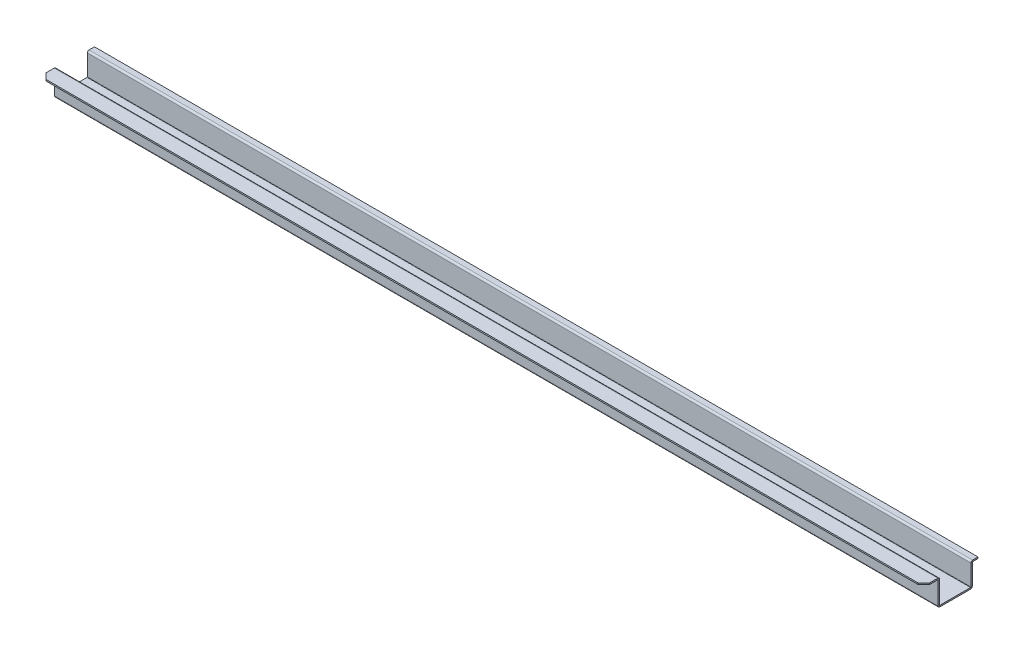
ISO-10303-21;
HEADER;
FILE_DESCRIPTION(('STEP AP214'),'2;1');
FILE_NAME('part.step','',(''),(''),'','','');
FILE_SCHEMA(('AUTOMOTIVE_DESIGN { 1 0 10303 214 1 1 1 1 }'));
ENDSEC;
DATA;
#1=APPLICATION_CONTEXT('core data for automotive mechanical design processes');
#2=APPLICATION_PROTOCOL_DEFINITION('international standard','automotive_design',2000,#1);
#3=PRODUCT_CONTEXT('',#1,'mechanical');
#4=PRODUCT('Part','Part','',(#3));
#5=PRODUCT_RELATED_PRODUCT_CATEGORY('part','',(#4));
#6=PRODUCT_DEFINITION_FORMATION('','',#4);
#7=PRODUCT_DEFINITION_CONTEXT('part definition',#1,'design');
#8=PRODUCT_DEFINITION('design','',#6,#7);
#9=PRODUCT_DEFINITION_SHAPE('','',#8);
#10=(LENGTH_UNIT() NAMED_UNIT(*) SI_UNIT(.MILLI.,.METRE.));
#11=(NAMED_UNIT(*) PLANE_ANGLE_UNIT() SI_UNIT($,.RADIAN.));
#12=(NAMED_UNIT(*) SI_UNIT($,.STERADIAN.) SOLID_ANGLE_UNIT());
#13=UNCERTAINTY_MEASURE_WITH_UNIT(LENGTH_MEASURE(1.E-05),#10,'distance_accuracy_value','');
#14=(GEOMETRIC_REPRESENTATION_CONTEXT(3) GLOBAL_UNCERTAINTY_ASSIGNED_CONTEXT((#13)) GLOBAL_UNIT_ASSIGNED_CONTEXT((#10,
#11,#12)) REPRESENTATION_CONTEXT('',''));
#15=CARTESIAN_POINT('',(0.,0.,0.));
#16=DIRECTION('',(0.,0.,1.));
#17=DIRECTION('',(1.,0.,0.));
#18=AXIS2_PLACEMENT_3D('',#15,#16,#17);
#19=CARTESIAN_POINT('',(1550.,-6.,0.));
#20=DIRECTION('',(1.,0.,0.));
#21=DIRECTION('',(0.,0.,-1.));
#22=AXIS2_PLACEMENT_3D('',#19,#20,#21);
#23=PLANE('',#22);
#24=DIRECTION('',(0.,0.,1.));
#25=VECTOR('',#24,1.);
#26=CARTESIAN_POINT('',(1550.,-6.,0.));
#27=LINE('',#26,#25);
#28=CARTESIAN_POINT('',(1550.,-6.,0.));
#29=VERTEX_POINT('',#28);
#30=CARTESIAN_POINT('',(1550.,-6.,5.));
#31=VERTEX_POINT('',#30);
#32=EDGE_CURVE('E395',#29,#31,#27,.T.);
#33=ORIENTED_EDGE('',*,*,#32,.F.);
#34=CARTESIAN_POINT('',(1550.,-6.,6.));
#35=DIRECTION('',(1.,0.,0.));
#36=DIRECTION('',(0.,0.,-1.));
#37=AXIS2_PLACEMENT_3D('',#34,#35,#36);
#38=CIRCLE('',#37,6.);
#39=CARTESIAN_POINT('',(1550.,0.,6.));
#40=VERTEX_POINT('',#39);
#41=EDGE_CURVE('E235',#40,#29,#38,.F.);
#42=ORIENTED_EDGE('',*,*,#41,.F.);
#43=DIRECTION('',(0.,1.,0.));
#44=VECTOR('',#43,1.);
#45=CARTESIAN_POINT('',(1550.,-5.,6.));
#46=LINE('',#45,#44);
#47=CARTESIAN_POINT('',(1550.,-5.,6.));
#48=VERTEX_POINT('',#47);
#49=EDGE_CURVE('E392',#48,#40,#46,.T.);
#50=ORIENTED_EDGE('',*,*,#49,.F.);
#51=CARTESIAN_POINT('',(1550.,-6.,6.));
#52=DIRECTION('',(1.,0.,0.));
#53=DIRECTION('',(0.,0.,-1.));
#54=AXIS2_PLACEMENT_3D('',#51,#52,#53);
#55=CIRCLE('',#54,1.);
#56=EDGE_CURVE('E242',#48,#31,#55,.F.);
#57=ORIENTED_EDGE('',*,*,#56,.T.);
#58=EDGE_LOOP('',(#33,#42,#50,#57));
#59=FACE_BOUND('',#58,.T.);
#60=ADVANCED_FACE('F39',(#59),#23,.T.);
#61=CARTESIAN_POINT('',(1550.,-5.,6.));
#62=DIRECTION('',(1.,0.,0.));
#63=DIRECTION('',(0.,0.,-1.));
#64=AXIS2_PLACEMENT_3D('',#61,#62,#63);
#65=PLANE('',#64);
#66=DIRECTION('',(0.,-1.,0.));
#67=VECTOR('',#66,1.);
#68=CARTESIAN_POINT('',(1550.,0.,0.));
#69=LINE('',#68,#67);
#70=CARTESIAN_POINT('',(1550.,-85.,0.));
#71=VERTEX_POINT('',#70);
#72=EDGE_CURVE('E232',#29,#71,#69,.T.);
#73=ORIENTED_EDGE('',*,*,#72,.F.);
#74=ORIENTED_EDGE('',*,*,#32,.T.);
#75=DIRECTION('',(0.,-1.,0.));
#76=VECTOR('',#75,1.);
#77=CARTESIAN_POINT('',(1550.,0.,5.));
#78=LINE('',#77,#76);
#79=CARTESIAN_POINT('',(1550.,-85.,4.99999999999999));
#80=VERTEX_POINT('',#79);
#81=EDGE_CURVE('E245',#31,#80,#78,.T.);
#82=ORIENTED_EDGE('',*,*,#81,.T.);
#83=DIRECTION('',(0.,0.,-1.));
#84=VECTOR('',#83,1.);
#85=CARTESIAN_POINT('',(1550.,-85.,4.99999999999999));
#86=LINE('',#85,#84);
#87=EDGE_CURVE('E383',#80,#71,#86,.T.);
#88=ORIENTED_EDGE('',*,*,#87,.T.);
#89=EDGE_LOOP('',(#73,#74,#82,#88));
#90=FACE_BOUND('',#89,.T.);
#91=ADVANCED_FACE('F445',(#90),#65,.T.);
#92=CARTESIAN_POINT('',(-1550.,0.,6.));
#93=DIRECTION('',(-1.,0.,0.));
#94=DIRECTION('',(0.,0.,1.));
#95=AXIS2_PLACEMENT_3D('',#92,#93,#94);
#96=PLANE('',#95);
#97=DIRECTION('',(0.,-1.,0.));
#98=VECTOR('',#97,1.);
#99=CARTESIAN_POINT('',(-1550.,0.,6.));
#100=LINE('',#99,#98);
#101=CARTESIAN_POINT('',(-1550.,0.,6.));
#102=VERTEX_POINT('',#101);
#103=CARTESIAN_POINT('',(-1550.,-5.,6.));
#104=VERTEX_POINT('',#103);
#105=EDGE_CURVE('E389',#102,#104,#100,.T.);
#106=ORIENTED_EDGE('',*,*,#105,.F.);
#107=CARTESIAN_POINT('',(-1550.,-6.,6.));
#108=DIRECTION('',(1.,0.,0.));
#109=DIRECTION('',(0.,0.,-1.));
#110=AXIS2_PLACEMENT_3D('',#107,#108,#109);
#111=CIRCLE('',#110,6.);
#112=CARTESIAN_POINT('',(-1550.,-6.,0.));
#113=VERTEX_POINT('',#112);
#114=EDGE_CURVE('E287',#102,#113,#111,.F.);
#115=ORIENTED_EDGE('',*,*,#114,.T.);
#116=DIRECTION('',(0.,0.,-1.));
#117=VECTOR('',#116,1.);
#118=CARTESIAN_POINT('',(-1550.,-6.,5.));
#119=LINE('',#118,#117);
#120=CARTESIAN_POINT('',(-1550.,-6.,5.));
#121=VERTEX_POINT('',#120);
#122=EDGE_CURVE('E387',#121,#113,#119,.T.);
#123=ORIENTED_EDGE('',*,*,#122,.F.);
#124=CARTESIAN_POINT('',(-1550.,-6.,6.));
#125=DIRECTION('',(1.,0.,0.));
#126=DIRECTION('',(0.,0.,-1.));
#127=AXIS2_PLACEMENT_3D('',#124,#125,#126);
#128=CIRCLE('',#127,1.);
#129=EDGE_CURVE('E294',#104,#121,#128,.F.);
#130=ORIENTED_EDGE('',*,*,#129,.F.);
#131=EDGE_LOOP('',(#106,#115,#123,#130));
#132=FACE_BOUND('',#131,.T.);
#133=ADVANCED_FACE('F426',(#132),#96,.T.);
#134=CARTESIAN_POINT('',(-1550.,-6.,5.));
#135=DIRECTION('',(-1.,0.,0.));
#136=DIRECTION('',(0.,0.,1.));
#137=AXIS2_PLACEMENT_3D('',#134,#135,#136);
#138=PLANE('',#137);
#139=DIRECTION('',(0.,0.,-1.));
#140=VECTOR('',#139,1.);
#141=CARTESIAN_POINT('',(-1550.,-5.,0.));
#142=LINE('',#141,#140);
#143=CARTESIAN_POINT('',(-1550.,-5.,35.));
#144=VERTEX_POINT('',#143);
#145=EDGE_CURVE('E292',#144,#104,#142,.T.);
#146=ORIENTED_EDGE('',*,*,#145,.F.);
#147=DIRECTION('',(0.,1.,0.));
#148=VECTOR('',#147,1.);
#149=CARTESIAN_POINT('',(-1550.,-6.,35.));
#150=LINE('',#149,#148);
#151=CARTESIAN_POINT('',(-1550.,0.,35.));
#152=VERTEX_POINT('',#151);
#153=EDGE_CURVE('E406',#144,#152,#150,.T.);
#154=ORIENTED_EDGE('',*,*,#153,.T.);
#155=DIRECTION('',(0.,0.,-1.));
#156=VECTOR('',#155,1.);
#157=CARTESIAN_POINT('',(-1550.,0.,0.));
#158=LINE('',#157,#156);
#159=EDGE_CURVE('E290',#152,#102,#158,.T.);
#160=ORIENTED_EDGE('',*,*,#159,.T.);
#161=ORIENTED_EDGE('',*,*,#105,.T.);
#162=EDGE_LOOP('',(#146,#154,#160,#161));
#163=FACE_BOUND('',#162,.T.);
#164=ADVANCED_FACE('F412',(#163),#138,.T.);
#165=CARTESIAN_POINT('',(1550.,-86.,-1.00000000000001));
#166=DIRECTION('',(1.,0.,0.));
#167=DIRECTION('',(0.,0.,-1.));
#168=AXIS2_PLACEMENT_3D('',#165,#166,#167);
#169=PLANE('',#168);
#170=DIRECTION('',(0.,-1.,0.));
#171=VECTOR('',#170,1.);
#172=CARTESIAN_POINT('',(1550.,-86.,-1.00000000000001));
#173=LINE('',#172,#171);
#174=CARTESIAN_POINT('',(1550.,-86.,-1.00000000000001));
#175=VERTEX_POINT('',#174);
#176=CARTESIAN_POINT('',(1550.,-91.,-1.00000000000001));
#177=VERTEX_POINT('',#176);
#178=EDGE_CURVE('E385',#175,#177,#173,.T.);
#179=ORIENTED_EDGE('',*,*,#178,.F.);
#180=CARTESIAN_POINT('',(1550.,-85.,-1.00000000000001));
#181=DIRECTION('',(-1.,0.,0.));
#182=DIRECTION('',(0.,0.,1.));
#183=AXIS2_PLACEMENT_3D('',#180,#181,#182);
#184=CIRCLE('',#183,1.);
#185=EDGE_CURVE('E229',#71,#175,#184,.F.);
#186=ORIENTED_EDGE('',*,*,#185,.F.);
#187=ORIENTED_EDGE('',*,*,#87,.F.);
#188=CARTESIAN_POINT('',(1550.,-85.,-1.00000000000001));
#189=DIRECTION('',(1.,0.,0.));
#190=DIRECTION('',(0.,0.,-1.));
#191=AXIS2_PLACEMENT_3D('',#188,#189,#190);
#192=CIRCLE('',#191,6.);
#193=EDGE_CURVE('E248',#80,#177,#192,.T.);
#194=ORIENTED_EDGE('',*,*,#193,.T.);
#195=EDGE_LOOP('',(#179,#186,#187,#194));
#196=FACE_BOUND('',#195,.T.);
#197=ADVANCED_FACE('F458',(#196),#169,.T.);
#198=CARTESIAN_POINT('',(1550.,-85.,4.99999999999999));
#199=DIRECTION('',(1.,0.,0.));
#200=DIRECTION('',(0.,0.,-1.));
#201=AXIS2_PLACEMENT_3D('',#198,#199,#200);
#202=PLANE('',#201);
#203=DIRECTION('',(0.,0.,-1.));
#204=VECTOR('',#203,1.);
#205=CARTESIAN_POINT('',(1550.,-86.,0.));
#206=LINE('',#205,#204);
#207=CARTESIAN_POINT('',(1550.,-86.,-109.));
#208=VERTEX_POINT('',#207);
#209=EDGE_CURVE('E226',#175,#208,#206,.T.);
#210=ORIENTED_EDGE('',*,*,#209,.F.);
#211=ORIENTED_EDGE('',*,*,#178,.T.);
#212=DIRECTION('',(0.,0.,-1.));
#213=VECTOR('',#212,1.);
#214=CARTESIAN_POINT('',(1550.,-91.,0.));
#215=LINE('',#214,#213);
#216=CARTESIAN_POINT('',(1550.,-91.,-109.));
#217=VERTEX_POINT('',#216);
#218=EDGE_CURVE('E251',#177,#217,#215,.T.);
#219=ORIENTED_EDGE('',*,*,#218,.T.);
#220=DIRECTION('',(0.,1.,0.));
#221=VECTOR('',#220,1.);
#222=CARTESIAN_POINT('',(1550.,-91.,-109.));
#223=LINE('',#222,#221);
#224=EDGE_CURVE('E375',#217,#208,#223,.T.);
#225=ORIENTED_EDGE('',*,*,#224,.T.);
#226=EDGE_LOOP('',(#210,#211,#219,#225));
#227=FACE_BOUND('',#226,.T.);
#228=ADVANCED_FACE('F461',(#227),#202,.T.);
#229=CARTESIAN_POINT('',(-1550.,-85.,0.));
#230=DIRECTION('',(-1.,0.,0.));
#231=DIRECTION('',(0.,0.,1.));
#232=AXIS2_PLACEMENT_3D('',#229,#230,#231);
#233=PLANE('',#232);
#234=DIRECTION('',(0.,0.,1.));
#235=VECTOR('',#234,1.);
#236=CARTESIAN_POINT('',(-1550.,-85.,0.));
#237=LINE('',#236,#235);
#238=CARTESIAN_POINT('',(-1550.,-85.,0.));
#239=VERTEX_POINT('',#238);
#240=CARTESIAN_POINT('',(-1550.,-85.,4.99999999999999));
#241=VERTEX_POINT('',#240);
#242=EDGE_CURVE('E381',#239,#241,#237,.T.);
#243=ORIENTED_EDGE('',*,*,#242,.F.);
#244=CARTESIAN_POINT('',(-1550.,-85.,-1.00000000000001));
#245=DIRECTION('',(-1.,0.,0.));
#246=DIRECTION('',(0.,0.,1.));
#247=AXIS2_PLACEMENT_3D('',#244,#245,#246);
#248=CIRCLE('',#247,1.);
#249=CARTESIAN_POINT('',(-1550.,-86.,-1.00000000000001));
#250=VERTEX_POINT('',#249);
#251=EDGE_CURVE('E281',#239,#250,#248,.F.);
#252=ORIENTED_EDGE('',*,*,#251,.T.);
#253=DIRECTION('',(0.,1.,0.));
#254=VECTOR('',#253,1.);
#255=CARTESIAN_POINT('',(-1550.,-91.,-1.00000000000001));
#256=LINE('',#255,#254);
#257=CARTESIAN_POINT('',(-1550.,-91.,-1.00000000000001));
#258=VERTEX_POINT('',#257);
#259=EDGE_CURVE('E379',#258,#250,#256,.T.);
#260=ORIENTED_EDGE('',*,*,#259,.F.);
#261=CARTESIAN_POINT('',(-1550.,-85.,-1.00000000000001));
#262=DIRECTION('',(1.,0.,0.));
#263=DIRECTION('',(0.,0.,-1.));
#264=AXIS2_PLACEMENT_3D('',#261,#262,#263);
#265=CIRCLE('',#264,6.);
#266=EDGE_CURVE('E300',#241,#258,#265,.T.);
#267=ORIENTED_EDGE('',*,*,#266,.F.);
#268=EDGE_LOOP('',(#243,#252,#260,#267));
#269=FACE_BOUND('',#268,.T.);
#270=ADVANCED_FACE('F465',(#269),#233,.T.);
#271=CARTESIAN_POINT('',(-1550.,-91.,-1.00000000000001));
#272=DIRECTION('',(-1.,0.,0.));
#273=DIRECTION('',(0.,0.,1.));
#274=AXIS2_PLACEMENT_3D('',#271,#272,#273);
#275=PLANE('',#274);
#276=DIRECTION('',(0.,-1.,0.));
#277=VECTOR('',#276,1.);
#278=CARTESIAN_POINT('',(-1550.,0.,0.));
#279=LINE('',#278,#277);
#280=EDGE_CURVE('E284',#113,#239,#279,.T.);
#281=ORIENTED_EDGE('',*,*,#280,.T.);
#282=ORIENTED_EDGE('',*,*,#242,.T.);
#283=DIRECTION('',(0.,-1.,0.));
#284=VECTOR('',#283,1.);
#285=CARTESIAN_POINT('',(-1550.,0.,5.));
#286=LINE('',#285,#284);
#287=EDGE_CURVE('E297',#121,#241,#286,.T.);
#288=ORIENTED_EDGE('',*,*,#287,.F.);
#289=ORIENTED_EDGE('',*,*,#122,.T.);
#290=EDGE_LOOP('',(#281,#282,#288,#289));
#291=FACE_BOUND('',#290,.T.);
#292=ADVANCED_FACE('F469',(#291),#275,.T.);
#293=CARTESIAN_POINT('',(1550.,-85.,-110.));
#294=DIRECTION('',(1.,0.,0.));
#295=DIRECTION('',(0.,0.,-1.));
#296=AXIS2_PLACEMENT_3D('',#293,#294,#295);
#297=PLANE('',#296);
#298=DIRECTION('',(0.,0.,-1.));
#299=VECTOR('',#298,1.);
#300=CARTESIAN_POINT('',(1550.,-85.,-110.));
#301=LINE('',#300,#299);
#302=CARTESIAN_POINT('',(1550.,-85.,-110.));
#303=VERTEX_POINT('',#302);
#304=CARTESIAN_POINT('',(1550.,-85.,-115.));
#305=VERTEX_POINT('',#304);
#306=EDGE_CURVE('E377',#303,#305,#301,.T.);
#307=ORIENTED_EDGE('',*,*,#306,.F.);
#308=CARTESIAN_POINT('',(1550.,-85.,-109.));
#309=DIRECTION('',(-1.,0.,0.));
#310=DIRECTION('',(0.,0.,1.));
#311=AXIS2_PLACEMENT_3D('',#308,#309,#310);
#312=CIRCLE('',#311,1.);
#313=EDGE_CURVE('E223',#208,#303,#312,.F.);
#314=ORIENTED_EDGE('',*,*,#313,.F.);
#315=ORIENTED_EDGE('',*,*,#224,.F.);
#316=CARTESIAN_POINT('',(1550.,-85.,-109.));
#317=DIRECTION('',(1.,0.,0.));
#318=DIRECTION('',(0.,0.,-1.));
#319=AXIS2_PLACEMENT_3D('',#316,#317,#318);
#320=CIRCLE('',#319,6.);
#321=EDGE_CURVE('E254',#217,#305,#320,.T.);
#322=ORIENTED_EDGE('',*,*,#321,.T.);
#323=EDGE_LOOP('',(#307,#314,#315,#322));
#324=FACE_BOUND('',#323,.T.);
#325=ADVANCED_FACE('F473',(#324),#297,.T.);
#326=CARTESIAN_POINT('',(1550.,-91.,-109.));
#327=DIRECTION('',(1.,0.,0.));
#328=DIRECTION('',(0.,0.,-1.));
#329=AXIS2_PLACEMENT_3D('',#326,#327,#328);
#330=PLANE('',#329);
#331=DIRECTION('',(0.,1.,0.));
#332=VECTOR('',#331,1.);
#333=CARTESIAN_POINT('',(1550.,-86.,-110.));
#334=LINE('',#333,#332);
#335=CARTESIAN_POINT('',(1550.,-12.,-110.));
#336=VERTEX_POINT('',#335);
#337=EDGE_CURVE('E220',#303,#336,#334,.T.);
#338=ORIENTED_EDGE('',*,*,#337,.F.);
#339=ORIENTED_EDGE('',*,*,#306,.T.);
#340=DIRECTION('',(0.,1.,0.));
#341=VECTOR('',#340,1.);
#342=CARTESIAN_POINT('',(1550.,-86.,-115.));
#343=LINE('',#342,#341);
#344=CARTESIAN_POINT('',(1550.,-12.,-115.));
#345=VERTEX_POINT('',#344);
#346=EDGE_CURVE('E257',#305,#345,#343,.T.);
#347=ORIENTED_EDGE('',*,*,#346,.T.);
#348=DIRECTION('',(0.,0.,1.));
#349=VECTOR('',#348,1.);
#350=CARTESIAN_POINT('',(1550.,-12.,-115.));
#351=LINE('',#350,#349);
#352=EDGE_CURVE('E368',#345,#336,#351,.T.);
#353=ORIENTED_EDGE('',*,*,#352,.T.);
#354=EDGE_LOOP('',(#338,#339,#347,#353));
#355=FACE_BOUND('',#354,.T.);
#356=ADVANCED_FACE('F477',(#355),#330,.T.);
#357=CARTESIAN_POINT('',(-1550.,-86.,-109.));
#358=DIRECTION('',(-1.,0.,0.));
#359=DIRECTION('',(0.,0.,1.));
#360=AXIS2_PLACEMENT_3D('',#357,#358,#359);
#361=PLANE('',#360);
#362=DIRECTION('',(0.,-1.,0.));
#363=VECTOR('',#362,1.);
#364=CARTESIAN_POINT('',(-1550.,-86.,-109.));
#365=LINE('',#364,#363);
#366=CARTESIAN_POINT('',(-1550.,-86.,-109.));
#367=VERTEX_POINT('',#366);
#368=CARTESIAN_POINT('',(-1550.,-91.,-109.));
#369=VERTEX_POINT('',#368);
#370=EDGE_CURVE('E373',#367,#369,#365,.T.);
#371=ORIENTED_EDGE('',*,*,#370,.F.);
#372=CARTESIAN_POINT('',(-1550.,-85.,-109.));
#373=DIRECTION('',(-1.,0.,0.));
#374=DIRECTION('',(0.,0.,1.));
#375=AXIS2_PLACEMENT_3D('',#372,#373,#374);
#376=CIRCLE('',#375,1.);
#377=CARTESIAN_POINT('',(-1550.,-85.,-110.));
#378=VERTEX_POINT('',#377);
#379=EDGE_CURVE('E275',#367,#378,#376,.F.);
#380=ORIENTED_EDGE('',*,*,#379,.T.);
#381=DIRECTION('',(0.,0.,1.));
#382=VECTOR('',#381,1.);
#383=CARTESIAN_POINT('',(-1550.,-85.,-115.));
#384=LINE('',#383,#382);
#385=CARTESIAN_POINT('',(-1550.,-85.,-115.));
#386=VERTEX_POINT('',#385);
#387=EDGE_CURVE('E371',#386,#378,#384,.T.);
#388=ORIENTED_EDGE('',*,*,#387,.F.);
#389=CARTESIAN_POINT('',(-1550.,-85.,-109.));
#390=DIRECTION('',(1.,0.,0.));
#391=DIRECTION('',(0.,0.,-1.));
#392=AXIS2_PLACEMENT_3D('',#389,#390,#391);
#393=CIRCLE('',#392,6.);
#394=EDGE_CURVE('E306',#369,#386,#393,.T.);
#395=ORIENTED_EDGE('',*,*,#394,.F.);
#396=EDGE_LOOP('',(#371,#380,#388,#395));
#397=FACE_BOUND('',#396,.T.);
#398=ADVANCED_FACE('F481',(#397),#361,.T.);
#399=CARTESIAN_POINT('',(-1550.,-85.,-115.));
#400=DIRECTION('',(-1.,0.,0.));
#401=DIRECTION('',(0.,0.,1.));
#402=AXIS2_PLACEMENT_3D('',#399,#400,#401);
#403=PLANE('',#402);
#404=DIRECTION('',(0.,0.,-1.));
#405=VECTOR('',#404,1.);
#406=CARTESIAN_POINT('',(-1550.,-86.,0.));
#407=LINE('',#406,#405);
#408=EDGE_CURVE('E278',#250,#367,#407,.T.);
#409=ORIENTED_EDGE('',*,*,#408,.T.);
#410=ORIENTED_EDGE('',*,*,#370,.T.);
#411=DIRECTION('',(0.,0.,-1.));
#412=VECTOR('',#411,1.);
#413=CARTESIAN_POINT('',(-1550.,-91.,0.));
#414=LINE('',#413,#412);
#415=EDGE_CURVE('E303',#258,#369,#414,.T.);
#416=ORIENTED_EDGE('',*,*,#415,.F.);
#417=ORIENTED_EDGE('',*,*,#259,.T.);
#418=EDGE_LOOP('',(#409,#410,#416,#417));
#419=FACE_BOUND('',#418,.T.);
#420=ADVANCED_FACE('F485',(#419),#403,.T.);
#421=CARTESIAN_POINT('',(1550.,-5.99999999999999,-116.));
#422=DIRECTION('',(1.,0.,0.));
#423=DIRECTION('',(0.,0.,-1.));
#424=AXIS2_PLACEMENT_3D('',#421,#422,#423);
#425=PLANE('',#424);
#426=DIRECTION('',(0.,-1.,0.));
#427=VECTOR('',#426,1.);
#428=CARTESIAN_POINT('',(1550.,-5.99999999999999,-116.));
#429=LINE('',#428,#427);
#430=CARTESIAN_POINT('',(1550.,-5.99999999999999,-116.));
#431=VERTEX_POINT('',#430);
#432=CARTESIAN_POINT('',(1550.,-11.,-116.));
#433=VERTEX_POINT('',#432);
#434=EDGE_CURVE('E195',#431,#433,#429,.T.);
#435=ORIENTED_EDGE('',*,*,#434,.F.);
#436=CARTESIAN_POINT('',(1550.,-12.,-116.));
#437=DIRECTION('',(1.,0.,0.));
#438=DIRECTION('',(0.,0.,-1.));
#439=AXIS2_PLACEMENT_3D('',#436,#437,#438);
#440=CIRCLE('',#439,6.);
#441=EDGE_CURVE('E215',#336,#431,#440,.F.);
#442=ORIENTED_EDGE('',*,*,#441,.F.);
#443=ORIENTED_EDGE('',*,*,#352,.F.);
#444=CARTESIAN_POINT('',(1550.,-12.,-116.));
#445=DIRECTION('',(1.,0.,0.));
#446=DIRECTION('',(0.,0.,-1.));
#447=AXIS2_PLACEMENT_3D('',#444,#445,#446);
#448=CIRCLE('',#447,1.);
#449=EDGE_CURVE('E260',#345,#433,#448,.F.);
#450=ORIENTED_EDGE('',*,*,#449,.T.);
#451=EDGE_LOOP('',(#435,#442,#443,#450));
#452=FACE_BOUND('',#451,.T.);
#453=ADVANCED_FACE('F489',(#452),#425,.T.);
#454=CARTESIAN_POINT('',(1550.,-12.,-115.));
#455=DIRECTION('',(1.,0.,0.));
#456=DIRECTION('',(0.,0.,-1.));
#457=AXIS2_PLACEMENT_3D('',#454,#455,#456);
#458=PLANE('',#457);
#459=DIRECTION('',(0.,0.,-1.));
#460=VECTOR('',#459,1.);
#461=CARTESIAN_POINT('',(1550.,-5.99999999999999,-110.));
#462=LINE('',#461,#460);
#463=CARTESIAN_POINT('',(1550.,-5.99999999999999,-135.));
#464=VERTEX_POINT('',#463);
#465=EDGE_CURVE('E213',#431,#464,#462,.T.);
#466=ORIENTED_EDGE('',*,*,#465,.F.);
#467=ORIENTED_EDGE('',*,*,#434,.T.);
#468=DIRECTION('',(0.,0.,-1.));
#469=VECTOR('',#468,1.);
#470=CARTESIAN_POINT('',(1550.,-11.,-110.));
#471=LINE('',#470,#469);
#472=CARTESIAN_POINT('',(1550.,-11.,-135.));
#473=VERTEX_POINT('',#472);
#474=EDGE_CURVE('E188',#433,#473,#471,.T.);
#475=ORIENTED_EDGE('',*,*,#474,.T.);
#476=DIRECTION('',(0.,-1.,0.));
#477=VECTOR('',#476,1.);
#478=CARTESIAN_POINT('',(1550.,-5.99999999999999,-135.));
#479=LINE('',#478,#477);
#480=EDGE_CURVE('E193',#464,#473,#479,.T.);
#481=ORIENTED_EDGE('',*,*,#480,.F.);
#482=EDGE_LOOP('',(#466,#467,#475,#481));
#483=FACE_BOUND('',#482,.T.);
#484=ADVANCED_FACE('F191',(#483),#458,.T.);
#485=CARTESIAN_POINT('',(-1550.,-12.,-110.));
#486=DIRECTION('',(-1.,0.,0.));
#487=DIRECTION('',(0.,0.,1.));
#488=AXIS2_PLACEMENT_3D('',#485,#486,#487);
#489=PLANE('',#488);
#490=DIRECTION('',(0.,0.,-1.));
#491=VECTOR('',#490,1.);
#492=CARTESIAN_POINT('',(-1550.,-12.,-110.));
#493=LINE('',#492,#491);
#494=CARTESIAN_POINT('',(-1550.,-12.,-110.));
#495=VERTEX_POINT('',#494);
#496=CARTESIAN_POINT('',(-1550.,-12.,-115.));
#497=VERTEX_POINT('',#496);
#498=EDGE_CURVE('E366',#495,#497,#493,.T.);
#499=ORIENTED_EDGE('',*,*,#498,.F.);
#500=CARTESIAN_POINT('',(-1550.,-12.,-116.));
#501=DIRECTION('',(1.,0.,0.));
#502=DIRECTION('',(0.,0.,-1.));
#503=AXIS2_PLACEMENT_3D('',#500,#501,#502);
#504=CIRCLE('',#503,6.);
#505=CARTESIAN_POINT('',(-1550.,-5.99999999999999,-116.));
#506=VERTEX_POINT('',#505);
#507=EDGE_CURVE('E269',#495,#506,#504,.F.);
#508=ORIENTED_EDGE('',*,*,#507,.T.);
#509=DIRECTION('',(0.,1.,0.));
#510=VECTOR('',#509,1.);
#511=CARTESIAN_POINT('',(-1550.,-11.,-116.));
#512=LINE('',#511,#510);
#513=CARTESIAN_POINT('',(-1550.,-11.,-116.));
#514=VERTEX_POINT('',#513);
#515=EDGE_CURVE('E209',#514,#506,#512,.T.);
#516=ORIENTED_EDGE('',*,*,#515,.F.);
#517=CARTESIAN_POINT('',(-1550.,-12.,-116.));
#518=DIRECTION('',(1.,0.,0.));
#519=DIRECTION('',(0.,0.,-1.));
#520=AXIS2_PLACEMENT_3D('',#517,#518,#519);
#521=CIRCLE('',#520,1.);
#522=EDGE_CURVE('E199',#497,#514,#521,.F.);
#523=ORIENTED_EDGE('',*,*,#522,.F.);
#524=EDGE_LOOP('',(#499,#508,#516,#523));
#525=FACE_BOUND('',#524,.T.);
#526=ADVANCED_FACE('F496',(#525),#489,.T.);
#527=CARTESIAN_POINT('',(-1550.,-11.,-116.));
#528=DIRECTION('',(-1.,0.,0.));
#529=DIRECTION('',(0.,0.,1.));
#530=AXIS2_PLACEMENT_3D('',#527,#528,#529);
#531=PLANE('',#530);
#532=DIRECTION('',(0.,1.,0.));
#533=VECTOR('',#532,1.);
#534=CARTESIAN_POINT('',(-1550.,-86.,-110.));
#535=LINE('',#534,#533);
#536=EDGE_CURVE('E272',#378,#495,#535,.T.);
#537=ORIENTED_EDGE('',*,*,#536,.T.);
#538=ORIENTED_EDGE('',*,*,#498,.T.);
#539=DIRECTION('',(0.,1.,0.));
#540=VECTOR('',#539,1.);
#541=CARTESIAN_POINT('',(-1550.,-86.,-115.));
#542=LINE('',#541,#540);
#543=EDGE_CURVE('E309',#386,#497,#542,.T.);
#544=ORIENTED_EDGE('',*,*,#543,.F.);
#545=ORIENTED_EDGE('',*,*,#387,.T.);
#546=EDGE_LOOP('',(#537,#538,#544,#545));
#547=FACE_BOUND('',#546,.T.);
#548=ADVANCED_FACE('F499',(#547),#531,.T.);
#549=CARTESIAN_POINT('',(1550.,-11.,-110.));
#550=DIRECTION('',(0.,1.,0.));
#551=DIRECTION('',(0.,0.,1.));
#552=AXIS2_PLACEMENT_3D('',#549,#550,#551);
#553=PLANE('',#552);
#554=DIRECTION('',(0.,0.,-1.));
#555=VECTOR('',#554,1.);
#556=CARTESIAN_POINT('',(-1550.,-11.,-110.));
#557=LINE('',#556,#555);
#558=CARTESIAN_POINT('',(-1550.,-11.,-135.));
#559=VERTEX_POINT('',#558);
#560=EDGE_CURVE('E205',#514,#559,#557,.T.);
#561=ORIENTED_EDGE('',*,*,#560,.T.);
#562=DIRECTION('',(-1.,0.,0.));
#563=VECTOR('',#562,1.);
#564=CARTESIAN_POINT('',(1550.,-11.,-135.));
#565=LINE('',#564,#563);
#566=EDGE_CURVE('E202',#473,#559,#565,.T.);
#567=ORIENTED_EDGE('',*,*,#566,.F.);
#568=ORIENTED_EDGE('',*,*,#474,.F.);
#569=DIRECTION('',(-1.,0.,0.));
#570=VECTOR('',#569,1.);
#571=CARTESIAN_POINT('',(1550.,-11.,-116.));
#572=LINE('',#571,#570);
#573=EDGE_CURVE('E262',#433,#514,#572,.T.);
#574=ORIENTED_EDGE('',*,*,#573,.T.);
#575=EDGE_LOOP('',(#561,#567,#568,#574));
#576=FACE_BOUND('',#575,.T.);
#577=ADVANCED_FACE('F203',(#576),#553,.F.);
#578=CARTESIAN_POINT('',(1550.,-5.99999999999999,-135.));
#579=DIRECTION('',(0.,0.,-1.));
#580=DIRECTION('',(-1.,0.,0.));
#581=AXIS2_PLACEMENT_3D('',#578,#579,#580);
#582=PLANE('',#581);
#583=DIRECTION('',(0.,-1.,0.));
#584=VECTOR('',#583,1.);
#585=CARTESIAN_POINT('',(-1550.,-5.99999999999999,-135.));
#586=LINE('',#585,#584);
#587=CARTESIAN_POINT('',(-1550.,-5.99999999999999,-135.));
#588=VERTEX_POINT('',#587);
#589=EDGE_CURVE('E264',#588,#559,#586,.T.);
#590=ORIENTED_EDGE('',*,*,#589,.F.);
#591=DIRECTION('',(-1.,0.,0.));
#592=VECTOR('',#591,1.);
#593=CARTESIAN_POINT('',(1550.,-5.99999999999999,-135.));
#594=LINE('',#593,#592);
#595=EDGE_CURVE('E210',#464,#588,#594,.T.);
#596=ORIENTED_EDGE('',*,*,#595,.F.);
#597=ORIENTED_EDGE('',*,*,#480,.T.);
#598=ORIENTED_EDGE('',*,*,#566,.T.);
#599=EDGE_LOOP('',(#590,#596,#597,#598));
#600=FACE_BOUND('',#599,.T.);
#601=ADVANCED_FACE('F212',(#600),#582,.T.);
#602=CARTESIAN_POINT('',(1550.,-5.99999999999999,-110.));
#603=DIRECTION('',(0.,1.,0.));
#604=DIRECTION('',(0.,0.,1.));
#605=AXIS2_PLACEMENT_3D('',#602,#603,#604);
#606=PLANE('',#605);
#607=DIRECTION('',(0.,0.,-1.));
#608=VECTOR('',#607,1.);
#609=CARTESIAN_POINT('',(-1550.,-5.99999999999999,-110.));
#610=LINE('',#609,#608);
#611=EDGE_CURVE('E266',#506,#588,#610,.T.);
#612=ORIENTED_EDGE('',*,*,#611,.F.);
#613=DIRECTION('',(-1.,0.,0.));
#614=VECTOR('',#613,1.);
#615=CARTESIAN_POINT('',(1550.,-5.99999999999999,-116.));
#616=LINE('',#615,#614);
#617=EDGE_CURVE('E361',#431,#506,#616,.T.);
#618=ORIENTED_EDGE('',*,*,#617,.F.);
#619=ORIENTED_EDGE('',*,*,#465,.T.);
#620=ORIENTED_EDGE('',*,*,#595,.T.);
#621=EDGE_LOOP('',(#612,#618,#619,#620));
#622=FACE_BOUND('',#621,.T.);
#623=ADVANCED_FACE('F508',(#622),#606,.T.);
#624=CARTESIAN_POINT('',(1550.,-12.,-116.));
#625=DIRECTION('',(-1.,0.,0.));
#626=DIRECTION('',(0.,0.,1.));
#627=AXIS2_PLACEMENT_3D('',#624,#625,#626);
#628=CYLINDRICAL_SURFACE('',#627,6.);
#629=ORIENTED_EDGE('',*,*,#507,.F.);
#630=DIRECTION('',(-1.,0.,0.));
#631=VECTOR('',#630,1.);
#632=CARTESIAN_POINT('',(1550.,-12.,-110.));
#633=LINE('',#632,#631);
#634=EDGE_CURVE('E358',#336,#495,#633,.T.);
#635=ORIENTED_EDGE('',*,*,#634,.F.);
#636=ORIENTED_EDGE('',*,*,#441,.T.);
#637=ORIENTED_EDGE('',*,*,#617,.T.);
#638=EDGE_LOOP('',(#629,#635,#636,#637));
#639=FACE_BOUND('',#638,.T.);
#640=ADVANCED_FACE('F511',(#639),#628,.T.);
#641=CARTESIAN_POINT('',(1550.,-86.,-110.));
#642=DIRECTION('',(0.,0.,1.));
#643=DIRECTION('',(1.,0.,0.));
#644=AXIS2_PLACEMENT_3D('',#641,#642,#643);
#645=PLANE('',#644);
#646=ORIENTED_EDGE('',*,*,#536,.F.);
#647=DIRECTION('',(-1.,0.,0.));
#648=VECTOR('',#647,1.);
#649=CARTESIAN_POINT('',(1550.,-85.,-110.));
#650=LINE('',#649,#648);
#651=EDGE_CURVE('E355',#303,#378,#650,.T.);
#652=ORIENTED_EDGE('',*,*,#651,.F.);
#653=ORIENTED_EDGE('',*,*,#337,.T.);
#654=ORIENTED_EDGE('',*,*,#634,.T.);
#655=EDGE_LOOP('',(#646,#652,#653,#654));
#656=FACE_BOUND('',#655,.T.);
#657=ADVANCED_FACE('F515',(#656),#645,.T.);
#658=CARTESIAN_POINT('',(1550.,-85.,-109.));
#659=DIRECTION('',(-1.,0.,0.));
#660=DIRECTION('',(0.,0.,1.));
#661=AXIS2_PLACEMENT_3D('',#658,#659,#660);
#662=CYLINDRICAL_SURFACE('',#661,1.);
#663=ORIENTED_EDGE('',*,*,#379,.F.);
#664=DIRECTION('',(-1.,0.,0.));
#665=VECTOR('',#664,1.);
#666=CARTESIAN_POINT('',(1550.,-86.,-109.));
#667=LINE('',#666,#665);
#668=EDGE_CURVE('E352',#208,#367,#667,.T.);
#669=ORIENTED_EDGE('',*,*,#668,.F.);
#670=ORIENTED_EDGE('',*,*,#313,.T.);
#671=ORIENTED_EDGE('',*,*,#651,.T.);
#672=EDGE_LOOP('',(#663,#669,#670,#671));
#673=FACE_BOUND('',#672,.T.);
#674=ADVANCED_FACE('F519',(#673),#662,.F.);
#675=CARTESIAN_POINT('',(1550.,-86.,0.));
#676=DIRECTION('',(0.,1.,0.));
#677=DIRECTION('',(0.,0.,1.));
#678=AXIS2_PLACEMENT_3D('',#675,#676,#677);
#679=PLANE('',#678);
#680=ORIENTED_EDGE('',*,*,#408,.F.);
#681=DIRECTION('',(-1.,0.,0.));
#682=VECTOR('',#681,1.);
#683=CARTESIAN_POINT('',(1550.,-86.,-1.00000000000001));
#684=LINE('',#683,#682);
#685=EDGE_CURVE('E349',#175,#250,#684,.T.);
#686=ORIENTED_EDGE('',*,*,#685,.F.);
#687=ORIENTED_EDGE('',*,*,#209,.T.);
#688=ORIENTED_EDGE('',*,*,#668,.T.);
#689=EDGE_LOOP('',(#680,#686,#687,#688));
#690=FACE_BOUND('',#689,.T.);
#691=ADVANCED_FACE('F523',(#690),#679,.T.);
#692=CARTESIAN_POINT('',(1550.,-85.,-1.00000000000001));
#693=DIRECTION('',(-1.,0.,0.));
#694=DIRECTION('',(0.,0.,1.));
#695=AXIS2_PLACEMENT_3D('',#692,#693,#694);
#696=CYLINDRICAL_SURFACE('',#695,1.);
#697=ORIENTED_EDGE('',*,*,#251,.F.);
#698=DIRECTION('',(-1.,0.,0.));
#699=VECTOR('',#698,1.);
#700=CARTESIAN_POINT('',(1550.,-85.,0.));
#701=LINE('',#700,#699);
#702=EDGE_CURVE('E346',#71,#239,#701,.T.);
#703=ORIENTED_EDGE('',*,*,#702,.F.);
#704=ORIENTED_EDGE('',*,*,#185,.T.);
#705=ORIENTED_EDGE('',*,*,#685,.T.);
#706=EDGE_LOOP('',(#697,#703,#704,#705));
#707=FACE_BOUND('',#706,.T.);
#708=ADVANCED_FACE('F527',(#707),#696,.F.);
#709=CARTESIAN_POINT('',(1550.,0.,0.));
#710=DIRECTION('',(0.,0.,-1.));
#711=DIRECTION('',(0.,1.,0.));
#712=AXIS2_PLACEMENT_3D('',#709,#710,#711);
#713=PLANE('',#712);
#714=ORIENTED_EDGE('',*,*,#280,.F.);
#715=DIRECTION('',(-1.,0.,0.));
#716=VECTOR('',#715,1.);
#717=CARTESIAN_POINT('',(1550.,-6.,0.));
#718=LINE('',#717,#716);
#719=EDGE_CURVE('E343',#29,#113,#718,.T.);
#720=ORIENTED_EDGE('',*,*,#719,.F.);
#721=ORIENTED_EDGE('',*,*,#72,.T.);
#722=ORIENTED_EDGE('',*,*,#702,.T.);
#723=EDGE_LOOP('',(#714,#720,#721,#722));
#724=FACE_BOUND('',#723,.T.);
#725=ADVANCED_FACE('F531',(#724),#713,.T.);
#726=CARTESIAN_POINT('',(1550.,-6.,6.));
#727=DIRECTION('',(-1.,0.,0.));
#728=DIRECTION('',(0.,0.,1.));
#729=AXIS2_PLACEMENT_3D('',#726,#727,#728);
#730=CYLINDRICAL_SURFACE('',#729,6.);
#731=ORIENTED_EDGE('',*,*,#114,.F.);
#732=DIRECTION('',(-1.,0.,0.));
#733=VECTOR('',#732,1.);
#734=CARTESIAN_POINT('',(1550.,0.,6.));
#735=LINE('',#734,#733);
#736=EDGE_CURVE('E340',#40,#102,#735,.T.);
#737=ORIENTED_EDGE('',*,*,#736,.F.);
#738=ORIENTED_EDGE('',*,*,#41,.T.);
#739=ORIENTED_EDGE('',*,*,#719,.T.);
#740=EDGE_LOOP('',(#731,#737,#738,#739));
#741=FACE_BOUND('',#740,.T.);
#742=ADVANCED_FACE('F422',(#741),#730,.T.);
#743=CARTESIAN_POINT('',(1550.,0.,0.));
#744=DIRECTION('',(0.,1.,0.));
#745=DIRECTION('',(0.,0.,1.));
#746=AXIS2_PLACEMENT_3D('',#743,#744,#745);
#747=PLANE('',#746);
#748=ORIENTED_EDGE('',*,*,#159,.F.);
#749=DIRECTION('',(-0.707106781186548,0.,-0.707106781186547));
#750=VECTOR('',#749,1.);
#751=CARTESIAN_POINT('',(-17.4999999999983,-1.91963385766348E-13,1567.5));
#752=LINE('',#751,#750);
#753=CARTESIAN_POINT('',(-1530.,0.,55.));
#754=VERTEX_POINT('',#753);
#755=EDGE_CURVE('E61',#152,#754,#752,.F.);
#756=ORIENTED_EDGE('',*,*,#755,.T.);
#757=DIRECTION('',(-1.,0.,0.));
#758=VECTOR('',#757,1.);
#759=CARTESIAN_POINT('',(1550.,0.,55.));
#760=LINE('',#759,#758);
#761=CARTESIAN_POINT('',(1530.,0.,55.));
#762=VERTEX_POINT('',#761);
#763=EDGE_CURVE('E338',#762,#754,#760,.T.);
#764=ORIENTED_EDGE('',*,*,#763,.F.);
#765=DIRECTION('',(-0.707106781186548,0.,0.707106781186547));
#766=VECTOR('',#765,1.);
#767=CARTESIAN_POINT('',(1567.5,0.,17.5));
#768=LINE('',#767,#766);
#769=CARTESIAN_POINT('',(1550.,0.,35.));
#770=VERTEX_POINT('',#769);
#771=EDGE_CURVE('E400',#762,#770,#768,.F.);
#772=ORIENTED_EDGE('',*,*,#771,.T.);
#773=DIRECTION('',(0.,0.,-1.));
#774=VECTOR('',#773,1.);
#775=CARTESIAN_POINT('',(1550.,0.,0.));
#776=LINE('',#775,#774);
#777=EDGE_CURVE('E238',#770,#40,#776,.T.);
#778=ORIENTED_EDGE('',*,*,#777,.T.);
#779=ORIENTED_EDGE('',*,*,#736,.T.);
#780=EDGE_LOOP('',(#748,#756,#764,#772,#778,#779));
#781=FACE_BOUND('',#780,.T.);
#782=ADVANCED_FACE('F416',(#781),#747,.T.);
#783=CARTESIAN_POINT('',(1550.,-5.00000000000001,55.));
#784=DIRECTION('',(0.,0.,1.));
#785=DIRECTION('',(1.,0.,0.));
#786=AXIS2_PLACEMENT_3D('',#783,#784,#785);
#787=PLANE('',#786);
#788=ORIENTED_EDGE('',*,*,#763,.T.);
#789=DIRECTION('',(0.,-1.,0.));
#790=VECTOR('',#789,1.);
#791=CARTESIAN_POINT('',(-1530.,-5.00000000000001,55.));
#792=LINE('',#791,#790);
#793=CARTESIAN_POINT('',(-1530.,-5.00000000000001,55.));
#794=VERTEX_POINT('',#793);
#795=EDGE_CURVE('E47',#754,#794,#792,.T.);
#796=ORIENTED_EDGE('',*,*,#795,.T.);
#797=DIRECTION('',(-1.,0.,0.));
#798=VECTOR('',#797,1.);
#799=CARTESIAN_POINT('',(1550.,-5.00000000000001,55.));
#800=LINE('',#799,#798);
#801=CARTESIAN_POINT('',(1530.,-5.00000000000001,55.));
#802=VERTEX_POINT('',#801);
#803=EDGE_CURVE('E336',#802,#794,#800,.T.);
#804=ORIENTED_EDGE('',*,*,#803,.F.);
#805=DIRECTION('',(0.,1.,0.));
#806=VECTOR('',#805,1.);
#807=CARTESIAN_POINT('',(1530.,-5.00000000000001,55.));
#808=LINE('',#807,#806);
#809=EDGE_CURVE('E397',#802,#762,#808,.T.);
#810=ORIENTED_EDGE('',*,*,#809,.T.);
#811=EDGE_LOOP('',(#788,#796,#804,#810));
#812=FACE_BOUND('',#811,.T.);
#813=ADVANCED_FACE('F540',(#812),#787,.T.);
#814=CARTESIAN_POINT('',(1550.,-5.,0.));
#815=DIRECTION('',(0.,1.,0.));
#816=DIRECTION('',(0.,0.,1.));
#817=AXIS2_PLACEMENT_3D('',#814,#815,#816);
#818=PLANE('',#817);
#819=ORIENTED_EDGE('',*,*,#803,.T.);
#820=DIRECTION('',(0.707106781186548,0.,0.707106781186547));
#821=VECTOR('',#820,1.);
#822=CARTESIAN_POINT('',(-1550.,-5.,35.));
#823=LINE('',#822,#821);
#824=EDGE_CURVE('E11',#794,#144,#823,.F.);
#825=ORIENTED_EDGE('',*,*,#824,.T.);
#826=ORIENTED_EDGE('',*,*,#145,.T.);
#827=DIRECTION('',(-1.,0.,0.));
#828=VECTOR('',#827,1.);
#829=CARTESIAN_POINT('',(1550.,-5.,6.));
#830=LINE('',#829,#828);
#831=EDGE_CURVE('E333',#48,#104,#830,.T.);
#832=ORIENTED_EDGE('',*,*,#831,.F.);
#833=DIRECTION('',(0.,0.,-1.));
#834=VECTOR('',#833,1.);
#835=CARTESIAN_POINT('',(1550.,-5.,0.));
#836=LINE('',#835,#834);
#837=CARTESIAN_POINT('',(1550.,-5.,35.));
#838=VERTEX_POINT('',#837);
#839=EDGE_CURVE('E240',#838,#48,#836,.T.);
#840=ORIENTED_EDGE('',*,*,#839,.F.);
#841=DIRECTION('',(0.707106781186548,0.,-0.707106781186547));
#842=VECTOR('',#841,1.);
#843=CARTESIAN_POINT('',(1530.,-5.00000000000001,55.));
#844=LINE('',#843,#842);
#845=EDGE_CURVE('E404',#838,#802,#844,.F.);
#846=ORIENTED_EDGE('',*,*,#845,.T.);
#847=EDGE_LOOP('',(#819,#825,#826,#832,#840,#846));
#848=FACE_BOUND('',#847,.T.);
#849=ADVANCED_FACE('F435',(#848),#818,.F.);
#850=CARTESIAN_POINT('',(1550.,-6.,6.));
#851=DIRECTION('',(-1.,0.,0.));
#852=DIRECTION('',(0.,0.,1.));
#853=AXIS2_PLACEMENT_3D('',#850,#851,#852);
#854=CYLINDRICAL_SURFACE('',#853,1.);
#855=ORIENTED_EDGE('',*,*,#129,.T.);
#856=DIRECTION('',(-1.,0.,0.));
#857=VECTOR('',#856,1.);
#858=CARTESIAN_POINT('',(1550.,-6.,5.));
#859=LINE('',#858,#857);
#860=EDGE_CURVE('E330',#31,#121,#859,.T.);
#861=ORIENTED_EDGE('',*,*,#860,.F.);
#862=ORIENTED_EDGE('',*,*,#56,.F.);
#863=ORIENTED_EDGE('',*,*,#831,.T.);
#864=EDGE_LOOP('',(#855,#861,#862,#863));
#865=FACE_BOUND('',#864,.T.);
#866=ADVANCED_FACE('F431',(#865),#854,.F.);
#867=CARTESIAN_POINT('',(1550.,0.,5.));
#868=DIRECTION('',(0.,0.,-1.));
#869=DIRECTION('',(0.,1.,0.));
#870=AXIS2_PLACEMENT_3D('',#867,#868,#869);
#871=PLANE('',#870);
#872=ORIENTED_EDGE('',*,*,#287,.T.);
#873=DIRECTION('',(-1.,0.,0.));
#874=VECTOR('',#873,1.);
#875=CARTESIAN_POINT('',(1550.,-85.,4.99999999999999));
#876=LINE('',#875,#874);
#877=EDGE_CURVE('E327',#80,#241,#876,.T.);
#878=ORIENTED_EDGE('',*,*,#877,.F.);
#879=ORIENTED_EDGE('',*,*,#81,.F.);
#880=ORIENTED_EDGE('',*,*,#860,.T.);
#881=EDGE_LOOP('',(#872,#878,#879,#880));
#882=FACE_BOUND('',#881,.T.);
#883=ADVANCED_FACE('F547',(#882),#871,.F.);
#884=CARTESIAN_POINT('',(1550.,-85.,-1.00000000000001));
#885=DIRECTION('',(-1.,0.,0.));
#886=DIRECTION('',(0.,0.,1.));
#887=AXIS2_PLACEMENT_3D('',#884,#885,#886);
#888=CYLINDRICAL_SURFACE('',#887,6.);
#889=ORIENTED_EDGE('',*,*,#266,.T.);
#890=DIRECTION('',(-1.,0.,0.));
#891=VECTOR('',#890,1.);
#892=CARTESIAN_POINT('',(1550.,-91.,-1.00000000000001));
#893=LINE('',#892,#891);
#894=EDGE_CURVE('E324',#177,#258,#893,.T.);
#895=ORIENTED_EDGE('',*,*,#894,.F.);
#896=ORIENTED_EDGE('',*,*,#193,.F.);
#897=ORIENTED_EDGE('',*,*,#877,.T.);
#898=EDGE_LOOP('',(#889,#895,#896,#897));
#899=FACE_BOUND('',#898,.T.);
#900=ADVANCED_FACE('F550',(#899),#888,.T.);
#901=CARTESIAN_POINT('',(1550.,-91.,0.));
#902=DIRECTION('',(0.,1.,0.));
#903=DIRECTION('',(0.,0.,1.));
#904=AXIS2_PLACEMENT_3D('',#901,#902,#903);
#905=PLANE('',#904);
#906=ORIENTED_EDGE('',*,*,#415,.T.);
#907=DIRECTION('',(-1.,0.,0.));
#908=VECTOR('',#907,1.);
#909=CARTESIAN_POINT('',(1550.,-91.,-109.));
#910=LINE('',#909,#908);
#911=EDGE_CURVE('E321',#217,#369,#910,.T.);
#912=ORIENTED_EDGE('',*,*,#911,.F.);
#913=ORIENTED_EDGE('',*,*,#218,.F.);
#914=ORIENTED_EDGE('',*,*,#894,.T.);
#915=EDGE_LOOP('',(#906,#912,#913,#914));
#916=FACE_BOUND('',#915,.T.);
#917=ADVANCED_FACE('F554',(#916),#905,.F.);
#918=CARTESIAN_POINT('',(1550.,-85.,-109.));
#919=DIRECTION('',(-1.,0.,0.));
#920=DIRECTION('',(0.,0.,1.));
#921=AXIS2_PLACEMENT_3D('',#918,#919,#920);
#922=CYLINDRICAL_SURFACE('',#921,6.);
#923=ORIENTED_EDGE('',*,*,#394,.T.);
#924=DIRECTION('',(-1.,0.,0.));
#925=VECTOR('',#924,1.);
#926=CARTESIAN_POINT('',(1550.,-85.,-115.));
#927=LINE('',#926,#925);
#928=EDGE_CURVE('E318',#305,#386,#927,.T.);
#929=ORIENTED_EDGE('',*,*,#928,.F.);
#930=ORIENTED_EDGE('',*,*,#321,.F.);
#931=ORIENTED_EDGE('',*,*,#911,.T.);
#932=EDGE_LOOP('',(#923,#929,#930,#931));
#933=FACE_BOUND('',#932,.T.);
#934=ADVANCED_FACE('F558',(#933),#922,.T.);
#935=CARTESIAN_POINT('',(1550.,-86.,-115.));
#936=DIRECTION('',(0.,0.,1.));
#937=DIRECTION('',(1.,0.,0.));
#938=AXIS2_PLACEMENT_3D('',#935,#936,#937);
#939=PLANE('',#938);
#940=ORIENTED_EDGE('',*,*,#543,.T.);
#941=DIRECTION('',(-1.,0.,0.));
#942=VECTOR('',#941,1.);
#943=CARTESIAN_POINT('',(1550.,-12.,-115.));
#944=LINE('',#943,#942);
#945=EDGE_CURVE('E315',#345,#497,#944,.T.);
#946=ORIENTED_EDGE('',*,*,#945,.F.);
#947=ORIENTED_EDGE('',*,*,#346,.F.);
#948=ORIENTED_EDGE('',*,*,#928,.T.);
#949=EDGE_LOOP('',(#940,#946,#947,#948));
#950=FACE_BOUND('',#949,.T.);
#951=ADVANCED_FACE('F562',(#950),#939,.F.);
#952=CARTESIAN_POINT('',(1550.,-12.,-116.));
#953=DIRECTION('',(-1.,0.,0.));
#954=DIRECTION('',(0.,0.,1.));
#955=AXIS2_PLACEMENT_3D('',#952,#953,#954);
#956=CYLINDRICAL_SURFACE('',#955,1.);
#957=ORIENTED_EDGE('',*,*,#522,.T.);
#958=ORIENTED_EDGE('',*,*,#573,.F.);
#959=ORIENTED_EDGE('',*,*,#449,.F.);
#960=ORIENTED_EDGE('',*,*,#945,.T.);
#961=EDGE_LOOP('',(#957,#958,#959,#960));
#962=FACE_BOUND('',#961,.T.);
#963=ADVANCED_FACE('F566',(#962),#956,.F.);
#964=CARTESIAN_POINT('',(1550.,-12.,-116.));
#965=DIRECTION('',(1.,0.,0.));
#966=DIRECTION('',(0.,0.,-1.));
#967=AXIS2_PLACEMENT_3D('',#964,#965,#966);
#968=PLANE('',#967);
#969=ORIENTED_EDGE('',*,*,#777,.F.);
#970=DIRECTION('',(0.,-1.,0.));
#971=VECTOR('',#970,1.);
#972=CARTESIAN_POINT('',(1550.,-12.,35.));
#973=LINE('',#972,#971);
#974=EDGE_CURVE('E402',#770,#838,#973,.T.);
#975=ORIENTED_EDGE('',*,*,#974,.T.);
#976=ORIENTED_EDGE('',*,*,#839,.T.);
#977=ORIENTED_EDGE('',*,*,#49,.T.);
#978=EDGE_LOOP('',(#969,#975,#976,#977));
#979=FACE_BOUND('',#978,.T.);
#980=ADVANCED_FACE('F570',(#979),#968,.T.);
#981=CARTESIAN_POINT('',(-1550.,-12.,-116.));
#982=DIRECTION('',(1.,0.,0.));
#983=DIRECTION('',(0.,0.,-1.));
#984=AXIS2_PLACEMENT_3D('',#981,#982,#983);
#985=PLANE('',#984);
#986=ORIENTED_EDGE('',*,*,#560,.F.);
#987=ORIENTED_EDGE('',*,*,#515,.T.);
#988=ORIENTED_EDGE('',*,*,#611,.T.);
#989=ORIENTED_EDGE('',*,*,#589,.T.);
#990=EDGE_LOOP('',(#986,#987,#988,#989));
#991=FACE_BOUND('',#990,.T.);
#992=ADVANCED_FACE('F442',(#991),#985,.F.);
#993=CARTESIAN_POINT('',(1530.,-5.00000000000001,55.));
#994=DIRECTION('',(-0.707106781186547,0.,-0.707106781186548));
#995=DIRECTION('',(-0.707106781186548,0.,0.707106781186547));
#996=AXIS2_PLACEMENT_3D('',#993,#994,#995);
#997=PLANE('',#996);
#998=ORIENTED_EDGE('',*,*,#845,.F.);
#999=ORIENTED_EDGE('',*,*,#974,.F.);
#1000=ORIENTED_EDGE('',*,*,#771,.F.);
#1001=ORIENTED_EDGE('',*,*,#809,.F.);
#1002=EDGE_LOOP('',(#998,#999,#1000,#1001));
#1003=FACE_BOUND('',#1002,.T.);
#1004=ADVANCED_FACE('F438',(#1003),#997,.F.);
#1005=CARTESIAN_POINT('',(-1550.,-6.,35.));
#1006=DIRECTION('',(0.707106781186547,0.,-0.707106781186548));
#1007=DIRECTION('',(-0.707106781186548,0.,-0.707106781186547));
#1008=AXIS2_PLACEMENT_3D('',#1005,#1006,#1007);
#1009=PLANE('',#1008);
#1010=ORIENTED_EDGE('',*,*,#824,.F.);
#1011=ORIENTED_EDGE('',*,*,#795,.F.);
#1012=ORIENTED_EDGE('',*,*,#755,.F.);
#1013=ORIENTED_EDGE('',*,*,#153,.F.);
#1014=EDGE_LOOP('',(#1010,#1011,#1012,#1013));
#1015=FACE_BOUND('',#1014,.T.);
#1016=ADVANCED_FACE('F41',(#1015),#1009,.F.);
#1017=CLOSED_SHELL('',(#60,#91,#133,#164,#197,#228,#270,#292,#325,#356,#398,#420,#453,#484,#526,
#548,#577,#601,#623,#640,#657,#674,#691,#708,#725,#742,#782,#813,#849,#866,#883,#900,#917,#934,
#951,#963,#980,#992,#1004,#1016));
#1018=MANIFOLD_SOLID_BREP('B2',#1017);
#1019=ADVANCED_BREP_SHAPE_REPRESENTATION('',(#18,#1018),#14);
#1020=SHAPE_DEFINITION_REPRESENTATION(#9,#1019);
ENDSEC;
END-ISO-10303-21;
